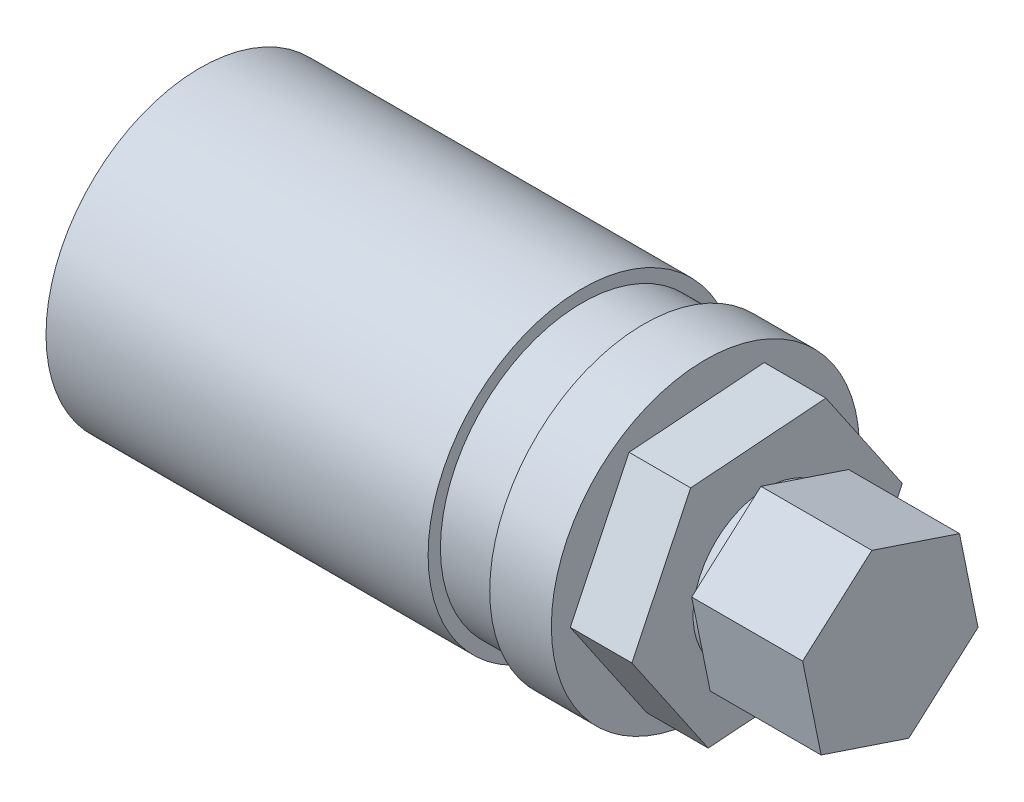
ISO-10303-21;
HEADER;
FILE_DESCRIPTION(('STEP AP214'),'2;1');
FILE_NAME('part.step','',(''),(''),'','','');
FILE_SCHEMA(('AUTOMOTIVE_DESIGN { 1 0 10303 214 1 1 1 1 }'));
ENDSEC;
DATA;
#1=APPLICATION_CONTEXT('core data for automotive mechanical design processes');
#2=APPLICATION_PROTOCOL_DEFINITION('international standard','automotive_design',2000,#1);
#3=PRODUCT_CONTEXT('',#1,'mechanical');
#4=PRODUCT('Part','Part','',(#3));
#5=PRODUCT_RELATED_PRODUCT_CATEGORY('part','',(#4));
#6=PRODUCT_DEFINITION_FORMATION('','',#4);
#7=PRODUCT_DEFINITION_CONTEXT('part definition',#1,'design');
#8=PRODUCT_DEFINITION('design','',#6,#7);
#9=PRODUCT_DEFINITION_SHAPE('','',#8);
#10=(LENGTH_UNIT() NAMED_UNIT(*) SI_UNIT(.MILLI.,.METRE.));
#11=(NAMED_UNIT(*) PLANE_ANGLE_UNIT() SI_UNIT($,.RADIAN.));
#12=(NAMED_UNIT(*) SI_UNIT($,.STERADIAN.) SOLID_ANGLE_UNIT());
#13=UNCERTAINTY_MEASURE_WITH_UNIT(LENGTH_MEASURE(1.E-05),#10,'distance_accuracy_value','');
#14=(GEOMETRIC_REPRESENTATION_CONTEXT(3) GLOBAL_UNCERTAINTY_ASSIGNED_CONTEXT((#13)) GLOBAL_UNIT_ASSIGNED_CONTEXT((#10,
#11,#12)) REPRESENTATION_CONTEXT('',''));
#15=CARTESIAN_POINT('',(0.,0.,0.));
#16=DIRECTION('',(0.,0.,1.));
#17=DIRECTION('',(1.,0.,0.));
#18=AXIS2_PLACEMENT_3D('',#15,#16,#17);
#19=CARTESIAN_POINT('',(41.,12.5,0.));
#20=DIRECTION('',(-1.,0.,0.));
#21=DIRECTION('',(0.,0.,1.));
#22=AXIS2_PLACEMENT_3D('',#19,#20,#21);
#23=PLANE('',#22);
#24=CARTESIAN_POINT('',(41.,0.,0.));
#25=DIRECTION('',(-1.,0.,0.));
#26=DIRECTION('',(0.,0.,1.));
#27=AXIS2_PLACEMENT_3D('',#24,#25,#26);
#28=CIRCLE('',#27,12.5);
#29=CARTESIAN_POINT('',(41.,0.,12.5));
#30=VERTEX_POINT('',#29);
#31=EDGE_CURVE('E198',#30,#30,#28,.T.);
#32=ORIENTED_EDGE('',*,*,#31,.F.);
#33=EDGE_LOOP('',(#32));
#34=FACE_BOUND('',#33,.T.);
#35=DIRECTION('',(0.,-0.074791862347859,0.997199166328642));
#36=VECTOR('',#35,1.);
#37=CARTESIAN_POINT('',(41.,9.91095316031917,-4.77210723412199));
#38=LINE('',#37,#36);
#39=CARTESIAN_POINT('',(41.,9.91095316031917,-4.77210723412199));
#40=VERTEX_POINT('',#39);
#41=CARTESIAN_POINT('',(41.,9.08824267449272,6.19708359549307));
#42=VERTEX_POINT('',#41);
#43=EDGE_CURVE('E49',#40,#42,#38,.T.);
#44=ORIENTED_EDGE('',*,*,#43,.F.);
#45=DIRECTION('',(0.,0.826203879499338,0.563371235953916));
#46=VECTOR('',#45,1.);
#47=CARTESIAN_POINT('',(41.,0.822710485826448,-10.9691908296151));
#48=LINE('',#47,#46);
#49=CARTESIAN_POINT('',(41.,0.822710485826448,-10.9691908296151));
#50=VERTEX_POINT('',#49);
#51=EDGE_CURVE('E53',#50,#40,#48,.T.);
#52=ORIENTED_EDGE('',*,*,#51,.F.);
#53=DIRECTION('',(0.,0.900995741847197,-0.433827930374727));
#54=VECTOR('',#53,1.);
#55=CARTESIAN_POINT('',(41.,-9.08824267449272,-6.19708359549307));
#56=LINE('',#55,#54);
#57=CARTESIAN_POINT('',(41.,-9.08824267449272,-6.19708359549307));
#58=VERTEX_POINT('',#57);
#59=EDGE_CURVE('E178',#58,#50,#56,.T.);
#60=ORIENTED_EDGE('',*,*,#59,.F.);
#61=DIRECTION('',(0.,0.0747918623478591,-0.997199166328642));
#62=VECTOR('',#61,1.);
#63=CARTESIAN_POINT('',(41.,-9.91095316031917,4.77210723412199));
#64=LINE('',#63,#62);
#65=CARTESIAN_POINT('',(41.,-9.91095316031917,4.77210723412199));
#66=VERTEX_POINT('',#65);
#67=EDGE_CURVE('E175',#66,#58,#64,.T.);
#68=ORIENTED_EDGE('',*,*,#67,.F.);
#69=DIRECTION('',(0.,-0.826203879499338,-0.563371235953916));
#70=VECTOR('',#69,1.);
#71=CARTESIAN_POINT('',(41.,-0.822710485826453,10.9691908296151));
#72=LINE('',#71,#70);
#73=CARTESIAN_POINT('',(41.,-0.822710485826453,10.9691908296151));
#74=VERTEX_POINT('',#73);
#75=EDGE_CURVE('E172',#74,#66,#72,.T.);
#76=ORIENTED_EDGE('',*,*,#75,.F.);
#77=DIRECTION('',(0.,-0.900995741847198,0.433827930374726));
#78=VECTOR('',#77,1.);
#79=CARTESIAN_POINT('',(41.,9.08824267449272,6.19708359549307));
#80=LINE('',#79,#78);
#81=EDGE_CURVE('E169',#42,#74,#80,.T.);
#82=ORIENTED_EDGE('',*,*,#81,.F.);
#83=EDGE_LOOP('',(#44,#52,#60,#68,#76,#82));
#84=FACE_BOUND('',#83,.T.);
#85=ADVANCED_FACE('F33',(#34,#84),#23,.F.);
#86=CARTESIAN_POINT('',(0.,0.,0.));
#87=DIRECTION('',(1.,0.,0.));
#88=DIRECTION('',(0.,0.,-1.));
#89=AXIS2_PLACEMENT_3D('',#86,#87,#88);
#90=PLANE('',#89);
#91=CARTESIAN_POINT('',(0.,0.,0.));
#92=DIRECTION('',(-1.,0.,0.));
#93=DIRECTION('',(0.,0.,1.));
#94=AXIS2_PLACEMENT_3D('',#91,#92,#93);
#95=CIRCLE('',#94,12.5);
#96=CARTESIAN_POINT('',(0.,0.,12.5));
#97=VERTEX_POINT('',#96);
#98=EDGE_CURVE('E37',#97,#97,#95,.T.);
#99=ORIENTED_EDGE('',*,*,#98,.T.);
#100=EDGE_LOOP('',(#99));
#101=FACE_BOUND('',#100,.T.);
#102=ADVANCED_FACE('F35',(#101),#90,.F.);
#103=CARTESIAN_POINT('',(0.,0.,0.));
#104=DIRECTION('',(-1.,0.,0.));
#105=DIRECTION('',(0.,0.,1.));
#106=AXIS2_PLACEMENT_3D('',#103,#104,#105);
#107=CYLINDRICAL_SURFACE('',#106,12.5);
#108=ORIENTED_EDGE('',*,*,#98,.F.);
#109=EDGE_LOOP('',(#108));
#110=FACE_BOUND('',#109,.T.);
#111=CARTESIAN_POINT('',(31.,0.,0.));
#112=DIRECTION('',(-1.,0.,0.));
#113=DIRECTION('',(0.,0.,1.));
#114=AXIS2_PLACEMENT_3D('',#111,#112,#113);
#115=CIRCLE('',#114,12.5);
#116=CARTESIAN_POINT('',(31.,0.,12.5));
#117=VERTEX_POINT('',#116);
#118=EDGE_CURVE('E209',#117,#117,#115,.T.);
#119=ORIENTED_EDGE('',*,*,#118,.T.);
#120=EDGE_LOOP('',(#119));
#121=FACE_BOUND('',#120,.T.);
#122=ADVANCED_FACE('F217',(#110,#121),#107,.T.);
#123=CARTESIAN_POINT('',(31.,12.5,0.));
#124=DIRECTION('',(-1.,0.,0.));
#125=DIRECTION('',(0.,0.,1.));
#126=AXIS2_PLACEMENT_3D('',#123,#124,#125);
#127=PLANE('',#126);
#128=ORIENTED_EDGE('',*,*,#118,.F.);
#129=EDGE_LOOP('',(#128));
#130=FACE_BOUND('',#129,.T.);
#131=CARTESIAN_POINT('',(31.,0.,0.));
#132=DIRECTION('',(-1.,0.,0.));
#133=DIRECTION('',(0.,0.,1.));
#134=AXIS2_PLACEMENT_3D('',#131,#132,#133);
#135=CIRCLE('',#134,11.5);
#136=CARTESIAN_POINT('',(31.,0.,11.5));
#137=VERTEX_POINT('',#136);
#138=EDGE_CURVE('E207',#137,#137,#135,.T.);
#139=ORIENTED_EDGE('',*,*,#138,.T.);
#140=EDGE_LOOP('',(#139));
#141=FACE_BOUND('',#140,.T.);
#142=ADVANCED_FACE('F219',(#130,#141),#127,.F.);
#143=CARTESIAN_POINT('',(0.,0.,0.));
#144=DIRECTION('',(-1.,0.,0.));
#145=DIRECTION('',(0.,0.,1.));
#146=AXIS2_PLACEMENT_3D('',#143,#144,#145);
#147=CYLINDRICAL_SURFACE('',#146,11.5);
#148=ORIENTED_EDGE('',*,*,#138,.F.);
#149=EDGE_LOOP('',(#148));
#150=FACE_BOUND('',#149,.T.);
#151=CARTESIAN_POINT('',(36.,0.,0.));
#152=DIRECTION('',(-1.,0.,0.));
#153=DIRECTION('',(0.,0.,1.));
#154=AXIS2_PLACEMENT_3D('',#151,#152,#153);
#155=CIRCLE('',#154,11.5);
#156=CARTESIAN_POINT('',(36.,0.,11.5));
#157=VERTEX_POINT('',#156);
#158=EDGE_CURVE('E204',#157,#157,#155,.T.);
#159=ORIENTED_EDGE('',*,*,#158,.T.);
#160=EDGE_LOOP('',(#159));
#161=FACE_BOUND('',#160,.T.);
#162=ADVANCED_FACE('F224',(#150,#161),#147,.T.);
#163=CARTESIAN_POINT('',(36.,11.5,0.));
#164=DIRECTION('',(1.,0.,0.));
#165=DIRECTION('',(0.,0.,-1.));
#166=AXIS2_PLACEMENT_3D('',#163,#164,#165);
#167=PLANE('',#166);
#168=ORIENTED_EDGE('',*,*,#158,.F.);
#169=EDGE_LOOP('',(#168));
#170=FACE_BOUND('',#169,.T.);
#171=CARTESIAN_POINT('',(36.,0.,0.));
#172=DIRECTION('',(-1.,0.,0.));
#173=DIRECTION('',(0.,0.,1.));
#174=AXIS2_PLACEMENT_3D('',#171,#172,#173);
#175=CIRCLE('',#174,12.5);
#176=CARTESIAN_POINT('',(36.,0.,12.5));
#177=VERTEX_POINT('',#176);
#178=EDGE_CURVE('E201',#177,#177,#175,.T.);
#179=ORIENTED_EDGE('',*,*,#178,.T.);
#180=EDGE_LOOP('',(#179));
#181=FACE_BOUND('',#180,.T.);
#182=ADVANCED_FACE('F240',(#170,#181),#167,.F.);
#183=CARTESIAN_POINT('',(0.,0.,0.));
#184=DIRECTION('',(-1.,0.,0.));
#185=DIRECTION('',(0.,0.,1.));
#186=AXIS2_PLACEMENT_3D('',#183,#184,#185);
#187=CYLINDRICAL_SURFACE('',#186,12.5);
#188=ORIENTED_EDGE('',*,*,#178,.F.);
#189=EDGE_LOOP('',(#188));
#190=FACE_BOUND('',#189,.T.);
#191=ORIENTED_EDGE('',*,*,#31,.T.);
#192=EDGE_LOOP('',(#191));
#193=FACE_BOUND('',#192,.T.);
#194=ADVANCED_FACE('F237',(#190,#193),#187,.T.);
#195=CARTESIAN_POINT('',(46.,9.91095316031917,-4.77210723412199));
#196=DIRECTION('',(0.,-0.997199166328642,-0.074791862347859));
#197=DIRECTION('',(0.,0.074791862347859,-0.997199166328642));
#198=AXIS2_PLACEMENT_3D('',#195,#196,#197);
#199=PLANE('',#198);
#200=ORIENTED_EDGE('',*,*,#43,.T.);
#201=DIRECTION('',(-1.,0.,0.));
#202=VECTOR('',#201,1.);
#203=CARTESIAN_POINT('',(46.,9.08824267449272,6.19708359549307));
#204=LINE('',#203,#202);
#205=CARTESIAN_POINT('',(46.,9.08824267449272,6.19708359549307));
#206=VERTEX_POINT('',#205);
#207=EDGE_CURVE('E195',#206,#42,#204,.T.);
#208=ORIENTED_EDGE('',*,*,#207,.F.);
#209=DIRECTION('',(0.,-0.074791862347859,0.997199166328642));
#210=VECTOR('',#209,1.);
#211=CARTESIAN_POINT('',(46.,9.91095316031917,-4.77210723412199));
#212=LINE('',#211,#210);
#213=CARTESIAN_POINT('',(46.,9.91095316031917,-4.77210723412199));
#214=VERTEX_POINT('',#213);
#215=EDGE_CURVE('E154',#214,#206,#212,.T.);
#216=ORIENTED_EDGE('',*,*,#215,.F.);
#217=DIRECTION('',(-1.,0.,0.));
#218=VECTOR('',#217,1.);
#219=CARTESIAN_POINT('',(46.,9.91095316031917,-4.77210723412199));
#220=LINE('',#219,#218);
#221=EDGE_CURVE('E167',#214,#40,#220,.T.);
#222=ORIENTED_EDGE('',*,*,#221,.T.);
#223=EDGE_LOOP('',(#200,#208,#216,#222));
#224=FACE_BOUND('',#223,.T.);
#225=ADVANCED_FACE('F235',(#224),#199,.F.);
#226=CARTESIAN_POINT('',(46.,9.08824267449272,6.19708359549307));
#227=DIRECTION('',(0.,-0.433827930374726,-0.900995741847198));
#228=DIRECTION('',(0.,0.900995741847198,-0.433827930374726));
#229=AXIS2_PLACEMENT_3D('',#226,#227,#228);
#230=PLANE('',#229);
#231=ORIENTED_EDGE('',*,*,#81,.T.);
#232=DIRECTION('',(-1.,0.,0.));
#233=VECTOR('',#232,1.);
#234=CARTESIAN_POINT('',(46.,-0.822710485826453,10.9691908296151));
#235=LINE('',#234,#233);
#236=CARTESIAN_POINT('',(46.,-0.822710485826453,10.9691908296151));
#237=VERTEX_POINT('',#236);
#238=EDGE_CURVE('E192',#237,#74,#235,.T.);
#239=ORIENTED_EDGE('',*,*,#238,.F.);
#240=DIRECTION('',(0.,-0.900995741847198,0.433827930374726));
#241=VECTOR('',#240,1.);
#242=CARTESIAN_POINT('',(46.,9.08824267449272,6.19708359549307));
#243=LINE('',#242,#241);
#244=EDGE_CURVE('E157',#206,#237,#243,.T.);
#245=ORIENTED_EDGE('',*,*,#244,.F.);
#246=ORIENTED_EDGE('',*,*,#207,.T.);
#247=EDGE_LOOP('',(#231,#239,#245,#246));
#248=FACE_BOUND('',#247,.T.);
#249=ADVANCED_FACE('F272',(#248),#230,.F.);
#250=CARTESIAN_POINT('',(46.,-0.822710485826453,10.9691908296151));
#251=DIRECTION('',(0.,0.563371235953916,-0.826203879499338));
#252=DIRECTION('',(0.,0.826203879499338,0.563371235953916));
#253=AXIS2_PLACEMENT_3D('',#250,#251,#252);
#254=PLANE('',#253);
#255=ORIENTED_EDGE('',*,*,#75,.T.);
#256=DIRECTION('',(-1.,0.,0.));
#257=VECTOR('',#256,1.);
#258=CARTESIAN_POINT('',(46.,-9.91095316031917,4.77210723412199));
#259=LINE('',#258,#257);
#260=CARTESIAN_POINT('',(46.,-9.91095316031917,4.77210723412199));
#261=VERTEX_POINT('',#260);
#262=EDGE_CURVE('E189',#261,#66,#259,.T.);
#263=ORIENTED_EDGE('',*,*,#262,.F.);
#264=DIRECTION('',(0.,-0.826203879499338,-0.563371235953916));
#265=VECTOR('',#264,1.);
#266=CARTESIAN_POINT('',(46.,-0.822710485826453,10.9691908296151));
#267=LINE('',#266,#265);
#268=EDGE_CURVE('E159',#237,#261,#267,.T.);
#269=ORIENTED_EDGE('',*,*,#268,.F.);
#270=ORIENTED_EDGE('',*,*,#238,.T.);
#271=EDGE_LOOP('',(#255,#263,#269,#270));
#272=FACE_BOUND('',#271,.T.);
#273=ADVANCED_FACE('F279',(#272),#254,.F.);
#274=CARTESIAN_POINT('',(46.,-9.91095316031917,4.77210723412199));
#275=DIRECTION('',(0.,0.997199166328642,0.0747918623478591));
#276=DIRECTION('',(0.,-0.0747918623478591,0.997199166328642));
#277=AXIS2_PLACEMENT_3D('',#274,#275,#276);
#278=PLANE('',#277);
#279=ORIENTED_EDGE('',*,*,#67,.T.);
#280=DIRECTION('',(-1.,0.,0.));
#281=VECTOR('',#280,1.);
#282=CARTESIAN_POINT('',(46.,-9.08824267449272,-6.19708359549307));
#283=LINE('',#282,#281);
#284=CARTESIAN_POINT('',(46.,-9.08824267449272,-6.19708359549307));
#285=VERTEX_POINT('',#284);
#286=EDGE_CURVE('E186',#285,#58,#283,.T.);
#287=ORIENTED_EDGE('',*,*,#286,.F.);
#288=DIRECTION('',(0.,0.0747918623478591,-0.997199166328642));
#289=VECTOR('',#288,1.);
#290=CARTESIAN_POINT('',(46.,-9.91095316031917,4.77210723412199));
#291=LINE('',#290,#289);
#292=EDGE_CURVE('E161',#261,#285,#291,.T.);
#293=ORIENTED_EDGE('',*,*,#292,.F.);
#294=ORIENTED_EDGE('',*,*,#262,.T.);
#295=EDGE_LOOP('',(#279,#287,#293,#294));
#296=FACE_BOUND('',#295,.T.);
#297=ADVANCED_FACE('F286',(#296),#278,.F.);
#298=CARTESIAN_POINT('',(46.,-9.08824267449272,-6.19708359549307));
#299=DIRECTION('',(0.,0.433827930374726,0.900995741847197));
#300=DIRECTION('',(0.,-0.900995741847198,0.433827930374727));
#301=AXIS2_PLACEMENT_3D('',#298,#299,#300);
#302=PLANE('',#301);
#303=ORIENTED_EDGE('',*,*,#59,.T.);
#304=DIRECTION('',(-1.,0.,0.));
#305=VECTOR('',#304,1.);
#306=CARTESIAN_POINT('',(46.,0.822710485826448,-10.9691908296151));
#307=LINE('',#306,#305);
#308=CARTESIAN_POINT('',(46.,0.822710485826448,-10.9691908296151));
#309=VERTEX_POINT('',#308);
#310=EDGE_CURVE('E183',#309,#50,#307,.T.);
#311=ORIENTED_EDGE('',*,*,#310,.F.);
#312=DIRECTION('',(0.,0.900995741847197,-0.433827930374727));
#313=VECTOR('',#312,1.);
#314=CARTESIAN_POINT('',(46.,-9.08824267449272,-6.19708359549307));
#315=LINE('',#314,#313);
#316=EDGE_CURVE('E163',#285,#309,#315,.T.);
#317=ORIENTED_EDGE('',*,*,#316,.F.);
#318=ORIENTED_EDGE('',*,*,#286,.T.);
#319=EDGE_LOOP('',(#303,#311,#317,#318));
#320=FACE_BOUND('',#319,.T.);
#321=ADVANCED_FACE('F294',(#320),#302,.F.);
#322=CARTESIAN_POINT('',(46.,0.822710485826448,-10.9691908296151));
#323=DIRECTION('',(0.,-0.563371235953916,0.826203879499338));
#324=DIRECTION('',(0.,-0.826203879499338,-0.563371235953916));
#325=AXIS2_PLACEMENT_3D('',#322,#323,#324);
#326=PLANE('',#325);
#327=ORIENTED_EDGE('',*,*,#51,.T.);
#328=ORIENTED_EDGE('',*,*,#221,.F.);
#329=DIRECTION('',(0.,0.826203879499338,0.563371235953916));
#330=VECTOR('',#329,1.);
#331=CARTESIAN_POINT('',(46.,0.822710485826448,-10.9691908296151));
#332=LINE('',#331,#330);
#333=EDGE_CURVE('E165',#309,#214,#332,.T.);
#334=ORIENTED_EDGE('',*,*,#333,.F.);
#335=ORIENTED_EDGE('',*,*,#310,.T.);
#336=EDGE_LOOP('',(#327,#328,#334,#335));
#337=FACE_BOUND('',#336,.T.);
#338=ADVANCED_FACE('F302',(#337),#326,.F.);
#339=CARTESIAN_POINT('',(46.,0.,0.));
#340=DIRECTION('',(1.,0.,0.));
#341=DIRECTION('',(0.,0.,-1.));
#342=AXIS2_PLACEMENT_3D('',#339,#340,#341);
#343=PLANE('',#342);
#344=CARTESIAN_POINT('',(46.,0.,0.));
#345=DIRECTION('',(1.,0.,0.));
#346=DIRECTION('',(0.,0.,-1.));
#347=AXIS2_PLACEMENT_3D('',#344,#345,#346);
#348=CIRCLE('',#347,6.);
#349=CARTESIAN_POINT('',(46.,0.,-6.));
#350=VERTEX_POINT('',#349);
#351=EDGE_CURVE('E11',#350,#350,#348,.T.);
#352=ORIENTED_EDGE('',*,*,#351,.F.);
#353=EDGE_LOOP('',(#352));
#354=FACE_BOUND('',#353,.T.);
#355=ORIENTED_EDGE('',*,*,#215,.T.);
#356=ORIENTED_EDGE('',*,*,#244,.T.);
#357=ORIENTED_EDGE('',*,*,#268,.T.);
#358=ORIENTED_EDGE('',*,*,#292,.T.);
#359=ORIENTED_EDGE('',*,*,#316,.T.);
#360=ORIENTED_EDGE('',*,*,#333,.T.);
#361=EDGE_LOOP('',(#355,#356,#357,#358,#359,#360));
#362=FACE_BOUND('',#361,.T.);
#363=ADVANCED_FACE('F310',(#354,#362),#343,.T.);
#364=CARTESIAN_POINT('',(47.,0.,0.));
#365=DIRECTION('',(-1.,0.,0.));
#366=DIRECTION('',(0.,0.,1.));
#367=AXIS2_PLACEMENT_3D('',#364,#365,#366);
#368=CYLINDRICAL_SURFACE('',#367,6.);
#369=CARTESIAN_POINT('',(47.,0.,0.));
#370=DIRECTION('',(1.,0.,0.));
#371=DIRECTION('',(0.,0.,-1.));
#372=AXIS2_PLACEMENT_3D('',#369,#370,#371);
#373=CIRCLE('',#372,6.);
#374=CARTESIAN_POINT('',(47.,0.,-6.));
#375=VERTEX_POINT('',#374);
#376=EDGE_CURVE('E146',#375,#375,#373,.T.);
#377=ORIENTED_EDGE('',*,*,#376,.F.);
#378=EDGE_LOOP('',(#377));
#379=FACE_BOUND('',#378,.T.);
#380=ORIENTED_EDGE('',*,*,#351,.T.);
#381=EDGE_LOOP('',(#380));
#382=FACE_BOUND('',#381,.T.);
#383=ADVANCED_FACE('F318',(#379,#382),#368,.T.);
#384=CARTESIAN_POINT('',(56.,4.97186042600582,-5.61521183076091));
#385=DIRECTION('',(0.,-0.948448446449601,0.316931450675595));
#386=DIRECTION('',(0.,-0.316931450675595,-0.948448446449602));
#387=AXIS2_PLACEMENT_3D('',#384,#385,#386);
#388=PLANE('',#387);
#389=DIRECTION('',(0.,0.316931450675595,0.948448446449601));
#390=VECTOR('',#389,1.);
#391=CARTESIAN_POINT('',(47.,4.97186042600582,-5.61521183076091));
#392=LINE('',#391,#390);
#393=CARTESIAN_POINT('',(47.,4.97186042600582,-5.61521183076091));
#394=VERTEX_POINT('',#393);
#395=CARTESIAN_POINT('',(47.,7.34884630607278,1.4981515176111));
#396=VERTEX_POINT('',#395);
#397=EDGE_CURVE('E145',#394,#396,#392,.T.);
#398=ORIENTED_EDGE('',*,*,#397,.T.);
#399=DIRECTION('',(-1.,0.,0.));
#400=VECTOR('',#399,1.);
#401=CARTESIAN_POINT('',(56.,7.34884630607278,1.4981515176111));
#402=LINE('',#401,#400);
#403=CARTESIAN_POINT('',(56.,7.34884630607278,1.4981515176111));
#404=VERTEX_POINT('',#403);
#405=EDGE_CURVE('E125',#404,#396,#402,.T.);
#406=ORIENTED_EDGE('',*,*,#405,.F.);
#407=DIRECTION('',(0.,0.316931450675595,0.948448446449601));
#408=VECTOR('',#407,1.);
#409=CARTESIAN_POINT('',(56.,4.97186042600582,-5.61521183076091));
#410=LINE('',#409,#408);
#411=CARTESIAN_POINT('',(56.,4.97186042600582,-5.61521183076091));
#412=VERTEX_POINT('',#411);
#413=EDGE_CURVE('E132',#412,#404,#410,.T.);
#414=ORIENTED_EDGE('',*,*,#413,.F.);
#415=DIRECTION('',(-1.,0.,0.));
#416=VECTOR('',#415,1.);
#417=CARTESIAN_POINT('',(56.,4.97186042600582,-5.61521183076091));
#418=LINE('',#417,#416);
#419=EDGE_CURVE('E461',#412,#394,#418,.T.);
#420=ORIENTED_EDGE('',*,*,#419,.T.);
#421=EDGE_LOOP('',(#398,#406,#414,#420));
#422=FACE_BOUND('',#421,.T.);
#423=ADVANCED_FACE('F143',(#422),#388,.F.);
#424=CARTESIAN_POINT('',(56.,7.34884630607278,1.4981515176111));
#425=DIRECTION('',(0.,-0.748694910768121,-0.662914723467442));
#426=DIRECTION('',(0.,0.662914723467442,-0.748694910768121));
#427=AXIS2_PLACEMENT_3D('',#424,#425,#426);
#428=PLANE('',#427);
#429=DIRECTION('',(0.,-0.662914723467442,0.748694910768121));
#430=VECTOR('',#429,1.);
#431=CARTESIAN_POINT('',(47.,7.34884630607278,1.4981515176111));
#432=LINE('',#431,#430);
#433=CARTESIAN_POINT('',(47.,2.37698588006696,7.11336334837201));
#434=VERTEX_POINT('',#433);
#435=EDGE_CURVE('E448',#396,#434,#432,.T.);
#436=ORIENTED_EDGE('',*,*,#435,.T.);
#437=DIRECTION('',(-1.,0.,0.));
#438=VECTOR('',#437,1.);
#439=CARTESIAN_POINT('',(56.,2.37698588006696,7.11336334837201));
#440=LINE('',#439,#438);
#441=CARTESIAN_POINT('',(56.,2.37698588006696,7.11336334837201));
#442=VERTEX_POINT('',#441);
#443=EDGE_CURVE('E128',#442,#434,#440,.T.);
#444=ORIENTED_EDGE('',*,*,#443,.F.);
#445=DIRECTION('',(0.,-0.662914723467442,0.748694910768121));
#446=VECTOR('',#445,1.);
#447=CARTESIAN_POINT('',(56.,7.34884630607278,1.4981515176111));
#448=LINE('',#447,#446);
#449=EDGE_CURVE('E121',#404,#442,#448,.T.);
#450=ORIENTED_EDGE('',*,*,#449,.F.);
#451=ORIENTED_EDGE('',*,*,#405,.T.);
#452=EDGE_LOOP('',(#436,#444,#450,#451));
#453=FACE_BOUND('',#452,.T.);
#454=ADVANCED_FACE('F123',(#453),#428,.F.);
#455=CARTESIAN_POINT('',(56.,2.37698588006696,7.11336334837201));
#456=DIRECTION('',(0.,0.199753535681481,-0.979846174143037));
#457=DIRECTION('',(0.,0.979846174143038,0.199753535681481));
#458=AXIS2_PLACEMENT_3D('',#455,#456,#457);
#459=PLANE('',#458);
#460=DIRECTION('',(0.,-0.979846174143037,-0.199753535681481));
#461=VECTOR('',#460,1.);
#462=CARTESIAN_POINT('',(47.,2.37698588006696,7.11336334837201));
#463=LINE('',#462,#461);
#464=CARTESIAN_POINT('',(47.,-4.97186042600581,5.61521183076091));
#465=VERTEX_POINT('',#464);
#466=EDGE_CURVE('E450',#434,#465,#463,.T.);
#467=ORIENTED_EDGE('',*,*,#466,.T.);
#468=DIRECTION('',(-1.,0.,0.));
#469=VECTOR('',#468,1.);
#470=CARTESIAN_POINT('',(56.,-4.97186042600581,5.61521183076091));
#471=LINE('',#470,#469);
#472=CARTESIAN_POINT('',(56.,-4.97186042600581,5.61521183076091));
#473=VERTEX_POINT('',#472);
#474=EDGE_CURVE('E150',#473,#465,#471,.T.);
#475=ORIENTED_EDGE('',*,*,#474,.F.);
#476=DIRECTION('',(0.,-0.979846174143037,-0.199753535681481));
#477=VECTOR('',#476,1.);
#478=CARTESIAN_POINT('',(56.,2.37698588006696,7.11336334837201));
#479=LINE('',#478,#477);
#480=EDGE_CURVE('E131',#442,#473,#479,.T.);
#481=ORIENTED_EDGE('',*,*,#480,.F.);
#482=ORIENTED_EDGE('',*,*,#443,.T.);
#483=EDGE_LOOP('',(#467,#475,#481,#482));
#484=FACE_BOUND('',#483,.T.);
#485=ADVANCED_FACE('F339',(#484),#459,.F.);
#486=CARTESIAN_POINT('',(56.,-4.97186042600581,5.61521183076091));
#487=DIRECTION('',(0.,0.948448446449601,-0.316931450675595));
#488=DIRECTION('',(0.,0.316931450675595,0.948448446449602));
#489=AXIS2_PLACEMENT_3D('',#486,#487,#488);
#490=PLANE('',#489);
#491=DIRECTION('',(0.,-0.316931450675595,-0.948448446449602));
#492=VECTOR('',#491,1.);
#493=CARTESIAN_POINT('',(47.,-4.97186042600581,5.61521183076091));
#494=LINE('',#493,#492);
#495=CARTESIAN_POINT('',(47.,-7.34884630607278,-1.4981515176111));
#496=VERTEX_POINT('',#495);
#497=EDGE_CURVE('E456',#465,#496,#494,.T.);
#498=ORIENTED_EDGE('',*,*,#497,.T.);
#499=DIRECTION('',(-1.,0.,0.));
#500=VECTOR('',#499,1.);
#501=CARTESIAN_POINT('',(56.,-7.34884630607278,-1.4981515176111));
#502=LINE('',#501,#500);
#503=CARTESIAN_POINT('',(56.,-7.34884630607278,-1.4981515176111));
#504=VERTEX_POINT('',#503);
#505=EDGE_CURVE('E466',#504,#496,#502,.T.);
#506=ORIENTED_EDGE('',*,*,#505,.F.);
#507=DIRECTION('',(0.,-0.316931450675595,-0.948448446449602));
#508=VECTOR('',#507,1.);
#509=CARTESIAN_POINT('',(56.,-4.97186042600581,5.61521183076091));
#510=LINE('',#509,#508);
#511=EDGE_CURVE('E473',#473,#504,#510,.T.);
#512=ORIENTED_EDGE('',*,*,#511,.F.);
#513=ORIENTED_EDGE('',*,*,#474,.T.);
#514=EDGE_LOOP('',(#498,#506,#512,#513));
#515=FACE_BOUND('',#514,.T.);
#516=ADVANCED_FACE('F346',(#515),#490,.F.);
#517=CARTESIAN_POINT('',(56.,-7.34884630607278,-1.4981515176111));
#518=DIRECTION('',(0.,0.748694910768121,0.662914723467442));
#519=DIRECTION('',(0.,-0.662914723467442,0.748694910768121));
#520=AXIS2_PLACEMENT_3D('',#517,#518,#519);
#521=PLANE('',#520);
#522=DIRECTION('',(0.,0.662914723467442,-0.748694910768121));
#523=VECTOR('',#522,1.);
#524=CARTESIAN_POINT('',(47.,-7.34884630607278,-1.4981515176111));
#525=LINE('',#524,#523);
#526=CARTESIAN_POINT('',(47.,-2.37698588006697,-7.11336334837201));
#527=VERTEX_POINT('',#526);
#528=EDGE_CURVE('E458',#496,#527,#525,.T.);
#529=ORIENTED_EDGE('',*,*,#528,.T.);
#530=DIRECTION('',(-1.,0.,0.));
#531=VECTOR('',#530,1.);
#532=CARTESIAN_POINT('',(56.,-2.37698588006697,-7.11336334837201));
#533=LINE('',#532,#531);
#534=CARTESIAN_POINT('',(56.,-2.37698588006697,-7.11336334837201));
#535=VERTEX_POINT('',#534);
#536=EDGE_CURVE('E463',#535,#527,#533,.T.);
#537=ORIENTED_EDGE('',*,*,#536,.F.);
#538=DIRECTION('',(0.,0.662914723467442,-0.748694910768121));
#539=VECTOR('',#538,1.);
#540=CARTESIAN_POINT('',(56.,-7.34884630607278,-1.4981515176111));
#541=LINE('',#540,#539);
#542=EDGE_CURVE('E476',#504,#535,#541,.T.);
#543=ORIENTED_EDGE('',*,*,#542,.F.);
#544=ORIENTED_EDGE('',*,*,#505,.T.);
#545=EDGE_LOOP('',(#529,#537,#543,#544));
#546=FACE_BOUND('',#545,.T.);
#547=ADVANCED_FACE('F354',(#546),#521,.F.);
#548=CARTESIAN_POINT('',(56.,-2.37698588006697,-7.11336334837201));
#549=DIRECTION('',(0.,-0.19975353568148,0.979846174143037));
#550=DIRECTION('',(0.,-0.979846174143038,-0.19975353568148));
#551=AXIS2_PLACEMENT_3D('',#548,#549,#550);
#552=PLANE('',#551);
#553=DIRECTION('',(0.,0.979846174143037,0.19975353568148));
#554=VECTOR('',#553,1.);
#555=CARTESIAN_POINT('',(47.,-2.37698588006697,-7.11336334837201));
#556=LINE('',#555,#554);
#557=EDGE_CURVE('E141',#527,#394,#556,.T.);
#558=ORIENTED_EDGE('',*,*,#557,.T.);
#559=ORIENTED_EDGE('',*,*,#419,.F.);
#560=DIRECTION('',(0.,0.979846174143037,0.19975353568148));
#561=VECTOR('',#560,1.);
#562=CARTESIAN_POINT('',(56.,-2.37698588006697,-7.11336334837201));
#563=LINE('',#562,#561);
#564=EDGE_CURVE('E137',#535,#412,#563,.T.);
#565=ORIENTED_EDGE('',*,*,#564,.F.);
#566=ORIENTED_EDGE('',*,*,#536,.T.);
#567=EDGE_LOOP('',(#558,#559,#565,#566));
#568=FACE_BOUND('',#567,.T.);
#569=ADVANCED_FACE('F362',(#568),#552,.F.);
#570=CARTESIAN_POINT('',(56.,0.,0.));
#571=DIRECTION('',(1.,0.,0.));
#572=DIRECTION('',(0.,0.,-1.));
#573=AXIS2_PLACEMENT_3D('',#570,#571,#572);
#574=PLANE('',#573);
#575=ORIENTED_EDGE('',*,*,#413,.T.);
#576=ORIENTED_EDGE('',*,*,#449,.T.);
#577=ORIENTED_EDGE('',*,*,#480,.T.);
#578=ORIENTED_EDGE('',*,*,#511,.T.);
#579=ORIENTED_EDGE('',*,*,#542,.T.);
#580=ORIENTED_EDGE('',*,*,#564,.T.);
#581=EDGE_LOOP('',(#575,#576,#577,#578,#579,#580));
#582=FACE_BOUND('',#581,.T.);
#583=ADVANCED_FACE('F135',(#582),#574,.T.);
#584=CARTESIAN_POINT('',(47.,0.,0.));
#585=DIRECTION('',(1.,0.,0.));
#586=DIRECTION('',(0.,0.,-1.));
#587=AXIS2_PLACEMENT_3D('',#584,#585,#586);
#588=PLANE('',#587);
#589=ORIENTED_EDGE('',*,*,#376,.T.);
#590=EDGE_LOOP('',(#589));
#591=FACE_BOUND('',#590,.T.);
#592=ORIENTED_EDGE('',*,*,#397,.F.);
#593=ORIENTED_EDGE('',*,*,#557,.F.);
#594=ORIENTED_EDGE('',*,*,#528,.F.);
#595=ORIENTED_EDGE('',*,*,#497,.F.);
#596=ORIENTED_EDGE('',*,*,#466,.F.);
#597=ORIENTED_EDGE('',*,*,#435,.F.);
#598=EDGE_LOOP('',(#592,#593,#594,#595,#596,#597));
#599=FACE_BOUND('',#598,.T.);
#600=ADVANCED_FACE('F377',(#591,#599),#588,.F.);
#601=CLOSED_SHELL('',(#85,#102,#122,#142,#162,#182,#194,#225,#249,#273,#297,#321,#338,#363,#383,
#423,#454,#485,#516,#547,#569,#583,#600));
#602=MANIFOLD_SOLID_BREP('B2',#601);
#603=ADVANCED_BREP_SHAPE_REPRESENTATION('',(#18,#602),#14);
#604=SHAPE_DEFINITION_REPRESENTATION(#9,#603);
ENDSEC;
END-ISO-10303-21;
